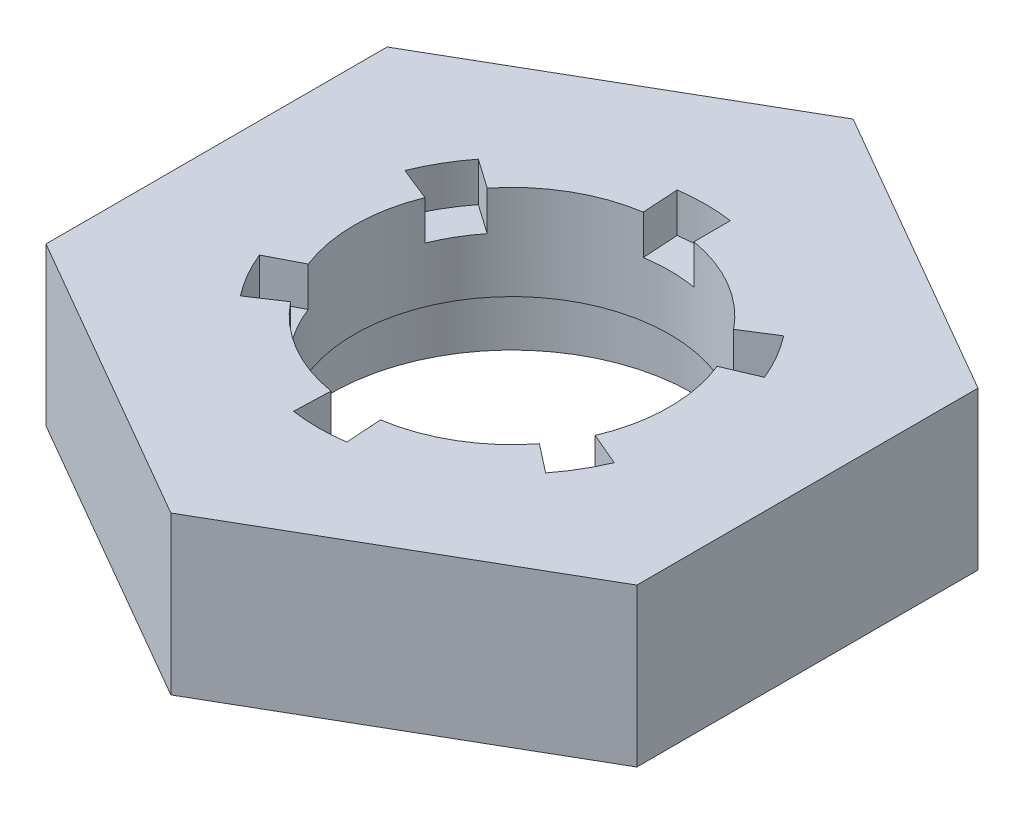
ISO-10303-21;
HEADER;
FILE_DESCRIPTION(('STEP AP214'),'2;1');
FILE_NAME('part.step','',(''),(''),'','','');
FILE_SCHEMA(('AUTOMOTIVE_DESIGN { 1 0 10303 214 1 1 1 1 }'));
ENDSEC;
DATA;
#1=APPLICATION_CONTEXT('core data for automotive mechanical design processes');
#2=APPLICATION_PROTOCOL_DEFINITION('international standard','automotive_design',2000,#1);
#3=PRODUCT_CONTEXT('',#1,'mechanical');
#4=PRODUCT('Part','Part','',(#3));
#5=PRODUCT_RELATED_PRODUCT_CATEGORY('part','',(#4));
#6=PRODUCT_DEFINITION_FORMATION('','',#4);
#7=PRODUCT_DEFINITION_CONTEXT('part definition',#1,'design');
#8=PRODUCT_DEFINITION('design','',#6,#7);
#9=PRODUCT_DEFINITION_SHAPE('','',#8);
#10=(LENGTH_UNIT() NAMED_UNIT(*) SI_UNIT(.MILLI.,.METRE.));
#11=(NAMED_UNIT(*) PLANE_ANGLE_UNIT() SI_UNIT($,.RADIAN.));
#12=(NAMED_UNIT(*) SI_UNIT($,.STERADIAN.) SOLID_ANGLE_UNIT());
#13=UNCERTAINTY_MEASURE_WITH_UNIT(LENGTH_MEASURE(1.E-05),#10,'distance_accuracy_value','');
#14=(GEOMETRIC_REPRESENTATION_CONTEXT(3) GLOBAL_UNCERTAINTY_ASSIGNED_CONTEXT((#13)) GLOBAL_UNIT_ASSIGNED_CONTEXT((#10,
#11,#12)) REPRESENTATION_CONTEXT('',''));
#15=CARTESIAN_POINT('',(0.,0.,0.));
#16=DIRECTION('',(0.,0.,1.));
#17=DIRECTION('',(1.,0.,0.));
#18=AXIS2_PLACEMENT_3D('',#15,#16,#17);
#19=CARTESIAN_POINT('',(37.4999999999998,10.,-64.95));
#20=DIRECTION('',(0.,-1.,0.));
#21=DIRECTION('',(0.,0.,-1.));
#22=AXIS2_PLACEMENT_3D('',#19,#20,#21);
#23=CYLINDRICAL_SURFACE('',#22,9.99999999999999);
#24=CARTESIAN_POINT('',(37.4999999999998,4.,-64.95));
#25=DIRECTION('',(0.,-1.,0.));
#26=DIRECTION('',(0.,0.,-1.));
#27=AXIS2_PLACEMENT_3D('',#24,#25,#26);
#28=CIRCLE('',#27,9.99999999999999);
#29=CARTESIAN_POINT('',(37.4999999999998,4.,-74.95));
#30=VERTEX_POINT('',#29);
#31=EDGE_CURVE('E38',#30,#30,#28,.T.);
#32=ORIENTED_EDGE('',*,*,#31,.T.);
#33=EDGE_LOOP('',(#32));
#34=FACE_BOUND('',#33,.T.);
#35=CARTESIAN_POINT('',(37.4999999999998,10.,-64.95));
#36=DIRECTION('',(0.,1.,0.));
#37=DIRECTION('',(0.,0.,1.));
#38=AXIS2_PLACEMENT_3D('',#35,#36,#37);
#39=CIRCLE('',#38,9.99999999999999);
#40=CARTESIAN_POINT('',(28.228574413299,10.,-68.6970878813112));
#41=VERTEX_POINT('',#40);
#42=CARTESIAN_POINT('',(28.1740695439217,10.,-61.3407035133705));
#43=VERTEX_POINT('',#42);
#44=EDGE_CURVE('E447',#41,#43,#39,.T.);
#45=ORIENTED_EDGE('',*,*,#44,.T.);
#46=DIRECTION('',(0.,1.,0.));
#47=VECTOR('',#46,1.);
#48=CARTESIAN_POINT('',(28.1740695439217,7.5,-61.3407035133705));
#49=LINE('',#48,#47);
#50=CARTESIAN_POINT('',(28.1740695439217,7.5,-61.3407035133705));
#51=VERTEX_POINT('',#50);
#52=EDGE_CURVE('E284',#51,#43,#49,.T.);
#53=ORIENTED_EDGE('',*,*,#52,.F.);
#54=CARTESIAN_POINT('',(37.4999999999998,7.5,-64.95));
#55=DIRECTION('',(0.,1.,0.));
#56=DIRECTION('',(0.,0.,1.));
#57=AXIS2_PLACEMENT_3D('',#54,#55,#56);
#58=CIRCLE('',#57,9.99999999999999);
#59=CARTESIAN_POINT('',(29.6867733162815,7.5,-58.7087269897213));
#60=VERTEX_POINT('',#59);
#61=EDGE_CURVE('E260',#60,#51,#58,.F.);
#62=ORIENTED_EDGE('',*,*,#61,.F.);
#63=DIRECTION('',(0.,1.,0.));
#64=VECTOR('',#63,1.);
#65=CARTESIAN_POINT('',(29.6867733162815,7.5,-58.7087269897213));
#66=LINE('',#65,#64);
#67=CARTESIAN_POINT('',(29.6867733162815,10.,-58.7087269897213));
#68=VERTEX_POINT('',#67);
#69=EDGE_CURVE('E250',#60,#68,#66,.T.);
#70=ORIENTED_EDGE('',*,*,#69,.T.);
#71=CARTESIAN_POINT('',(35.8820439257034,10.,-55.0817570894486));
#72=VERTEX_POINT('',#71);
#73=EDGE_CURVE('E451',#68,#72,#39,.T.);
#74=ORIENTED_EDGE('',*,*,#73,.T.);
#75=DIRECTION('',(0.,1.,0.));
#76=VECTOR('',#75,1.);
#77=CARTESIAN_POINT('',(35.8820439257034,7.5,-55.0817570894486));
#78=LINE('',#77,#76);
#79=CARTESIAN_POINT('',(35.8820439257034,7.5,-55.0817570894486));
#80=VERTEX_POINT('',#79);
#81=EDGE_CURVE('E308',#80,#72,#78,.T.);
#82=ORIENTED_EDGE('',*,*,#81,.F.);
#83=CARTESIAN_POINT('',(37.4999999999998,7.5,-64.95));
#84=DIRECTION('',(0.,1.,0.));
#85=DIRECTION('',(0.,0.,1.));
#86=AXIS2_PLACEMENT_3D('',#83,#84,#85);
#87=CIRCLE('',#86,9.99999999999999);
#88=CARTESIAN_POINT('',(39.032834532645,7.5,-55.0681773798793));
#89=VERTEX_POINT('',#88);
#90=EDGE_CURVE('E294',#89,#80,#87,.F.);
#91=ORIENTED_EDGE('',*,*,#90,.F.);
#92=DIRECTION('',(0.,1.,0.));
#93=VECTOR('',#92,1.);
#94=CARTESIAN_POINT('',(39.032834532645,7.5,-55.0681773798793));
#95=LINE('',#94,#93);
#96=CARTESIAN_POINT('',(39.032834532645,10.,-55.0681773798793));
#97=VERTEX_POINT('',#96);
#98=EDGE_CURVE('E311',#89,#97,#95,.T.);
#99=ORIENTED_EDGE('',*,*,#98,.T.);
#100=CARTESIAN_POINT('',(45.3856283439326,10.,-58.8004580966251));
#101=VERTEX_POINT('',#100);
#102=EDGE_CURVE('E555',#97,#101,#39,.T.);
#103=ORIENTED_EDGE('',*,*,#102,.T.);
#104=DIRECTION('',(0.,1.,0.));
#105=VECTOR('',#104,1.);
#106=CARTESIAN_POINT('',(45.3856283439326,7.5,-58.8004580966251));
#107=LINE('',#106,#105);
#108=CARTESIAN_POINT('',(45.3856283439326,7.5,-58.8004580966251));
#109=VERTEX_POINT('',#108);
#110=EDGE_CURVE('E334',#109,#101,#107,.T.);
#111=ORIENTED_EDGE('',*,*,#110,.F.);
#112=CARTESIAN_POINT('',(37.4999999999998,7.5,-64.95));
#113=DIRECTION('',(0.,1.,0.));
#114=DIRECTION('',(0.,0.,1.));
#115=AXIS2_PLACEMENT_3D('',#112,#113,#114);
#116=CIRCLE('',#115,9.99999999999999);
#117=CARTESIAN_POINT('',(46.6993393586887,7.5,-61.0292659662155));
#118=VERTEX_POINT('',#117);
#119=EDGE_CURVE('E324',#118,#109,#116,.F.);
#120=ORIENTED_EDGE('',*,*,#119,.F.);
#121=DIRECTION('',(0.,1.,0.));
#122=VECTOR('',#121,1.);
#123=CARTESIAN_POINT('',(46.6993393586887,7.5,-61.0292659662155));
#124=LINE('',#123,#122);
#125=CARTESIAN_POINT('',(46.6993393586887,10.,-61.0292659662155));
#126=VERTEX_POINT('',#125);
#127=EDGE_CURVE('E338',#118,#126,#124,.T.);
#128=ORIENTED_EDGE('',*,*,#127,.T.);
#129=CARTESIAN_POINT('',(46.7714255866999,10.,-68.6970878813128));
#130=VERTEX_POINT('',#129);
#131=EDGE_CURVE('E556',#126,#130,#39,.T.);
#132=ORIENTED_EDGE('',*,*,#131,.T.);
#133=DIRECTION('',(0.,1.,0.));
#134=VECTOR('',#133,1.);
#135=CARTESIAN_POINT('',(46.7714255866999,7.5,-68.6970878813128));
#136=LINE('',#135,#134);
#137=CARTESIAN_POINT('',(46.7714255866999,7.5,-68.6970878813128));
#138=VERTEX_POINT('',#137);
#139=EDGE_CURVE('E364',#138,#130,#136,.T.);
#140=ORIENTED_EDGE('',*,*,#139,.F.);
#141=CARTESIAN_POINT('',(37.4999999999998,7.5,-64.95));
#142=DIRECTION('',(0.,1.,0.));
#143=DIRECTION('',(0.,0.,1.));
#144=AXIS2_PLACEMENT_3D('',#141,#142,#143);
#145=CIRCLE('',#144,9.99999999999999);
#146=CARTESIAN_POINT('',(45.2645379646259,7.5,-71.2517418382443));
#147=VERTEX_POINT('',#146);
#148=EDGE_CURVE('E354',#147,#138,#145,.F.);
#149=ORIENTED_EDGE('',*,*,#148,.F.);
#150=DIRECTION('',(0.,1.,0.));
#151=VECTOR('',#150,1.);
#152=CARTESIAN_POINT('',(45.2645379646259,7.5,-71.2517418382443));
#153=LINE('',#152,#151);
#154=CARTESIAN_POINT('',(45.2645379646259,10.,-71.2517418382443));
#155=VERTEX_POINT('',#154);
#156=EDGE_CURVE('E368',#147,#155,#153,.T.);
#157=ORIENTED_EDGE('',*,*,#156,.T.);
#158=CARTESIAN_POINT('',(39.1914551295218,10.,-74.8059108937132));
#159=VERTEX_POINT('',#158);
#160=EDGE_CURVE('E559',#155,#159,#39,.T.);
#161=ORIENTED_EDGE('',*,*,#160,.T.);
#162=DIRECTION('',(0.,1.,0.));
#163=VECTOR('',#162,1.);
#164=CARTESIAN_POINT('',(39.1914551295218,7.5,-74.8059108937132));
#165=LINE('',#164,#163);
#166=CARTESIAN_POINT('',(39.1914551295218,7.5,-74.8059108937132));
#167=VERTEX_POINT('',#166);
#168=EDGE_CURVE('E394',#167,#159,#165,.T.);
#169=ORIENTED_EDGE('',*,*,#168,.F.);
#170=CARTESIAN_POINT('',(37.4999999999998,7.5,-64.95));
#171=DIRECTION('',(0.,1.,0.));
#172=DIRECTION('',(0.,0.,1.));
#173=AXIS2_PLACEMENT_3D('',#170,#171,#172);
#174=CIRCLE('',#173,9.99999999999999);
#175=CARTESIAN_POINT('',(35.9507430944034,7.5,-74.8292612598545));
#176=VERTEX_POINT('',#175);
#177=EDGE_CURVE('E384',#176,#167,#174,.F.);
#178=ORIENTED_EDGE('',*,*,#177,.F.);
#179=DIRECTION('',(0.,1.,0.));
#180=VECTOR('',#179,1.);
#181=CARTESIAN_POINT('',(35.9507430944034,7.5,-74.8292612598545));
#182=LINE('',#181,#180);
#183=CARTESIAN_POINT('',(35.9507430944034,10.,-74.8292612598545));
#184=VERTEX_POINT('',#183);
#185=EDGE_CURVE('E398',#176,#184,#182,.T.);
#186=ORIENTED_EDGE('',*,*,#185,.T.);
#187=CARTESIAN_POINT('',(29.6867733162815,10.,-71.1912730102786));
#188=VERTEX_POINT('',#187);
#189=EDGE_CURVE('E452',#184,#188,#39,.T.);
#190=ORIENTED_EDGE('',*,*,#189,.T.);
#191=DIRECTION('',(0.,1.,0.));
#192=VECTOR('',#191,1.);
#193=CARTESIAN_POINT('',(29.6867733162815,7.5,-71.1912730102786));
#194=LINE('',#193,#192);
#195=CARTESIAN_POINT('',(29.6867733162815,7.5,-71.1912730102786));
#196=VERTEX_POINT('',#195);
#197=EDGE_CURVE('E434',#196,#188,#194,.T.);
#198=ORIENTED_EDGE('',*,*,#197,.F.);
#199=CARTESIAN_POINT('',(37.4999999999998,7.5,-64.95));
#200=DIRECTION('',(0.,1.,0.));
#201=DIRECTION('',(0.,0.,1.));
#202=AXIS2_PLACEMENT_3D('',#199,#200,#201);
#203=CIRCLE('',#202,9.99999999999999);
#204=CARTESIAN_POINT('',(28.228574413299,7.5,-68.6970878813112));
#205=VERTEX_POINT('',#204);
#206=EDGE_CURVE('E412',#205,#196,#203,.F.);
#207=ORIENTED_EDGE('',*,*,#206,.F.);
#208=DIRECTION('',(0.,1.,0.));
#209=VECTOR('',#208,1.);
#210=CARTESIAN_POINT('',(28.228574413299,7.5,-68.6970878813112));
#211=LINE('',#210,#209);
#212=EDGE_CURVE('E437',#205,#41,#211,.T.);
#213=ORIENTED_EDGE('',*,*,#212,.T.);
#214=EDGE_LOOP('',(#45,#53,#62,#70,#74,#82,#91,#99,#103,#111,#120,#128,#132,#140,#149,#157,#161,
#169,#178,#186,#190,#198,#207,#213));
#215=FACE_BOUND('',#214,.T.);
#216=ADVANCED_FACE('F35',(#34,#215),#23,.F.);
#217=CARTESIAN_POINT('',(-39.812134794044,10.,-64.95));
#218=DIRECTION('',(0.,1.,0.));
#219=DIRECTION('',(0.,0.,1.));
#220=AXIS2_PLACEMENT_3D('',#217,#218,#219);
#221=PLANE('',#220);
#222=DIRECTION('',(-0.866025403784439,0.,-0.5));
#223=VECTOR('',#222,1.);
#224=CARTESIAN_POINT('',(-11.1091010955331,10.,-114.665112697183));
#225=LINE('',#224,#223);
#226=CARTESIAN_POINT('',(56.2499999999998,10.,-75.7753175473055));
#227=VERTEX_POINT('',#226);
#228=CARTESIAN_POINT('',(37.4999999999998,10.,-86.600635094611));
#229=VERTEX_POINT('',#228);
#230=EDGE_CURVE('E450',#227,#229,#225,.T.);
#231=ORIENTED_EDGE('',*,*,#230,.T.);
#232=DIRECTION('',(-0.866025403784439,0.,0.499999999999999));
#233=VECTOR('',#232,1.);
#234=CARTESIAN_POINT('',(-29.8591010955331,10.,-47.7108399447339));
#235=LINE('',#234,#233);
#236=CARTESIAN_POINT('',(18.7499999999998,10.,-75.7753175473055));
#237=VERTEX_POINT('',#236);
#238=EDGE_CURVE('E455',#229,#237,#235,.T.);
#239=ORIENTED_EDGE('',*,*,#238,.T.);
#240=DIRECTION('',(0.,0.,-1.));
#241=VECTOR('',#240,1.);
#242=CARTESIAN_POINT('',(18.7499999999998,10.,-64.95));
#243=LINE('',#242,#241);
#244=CARTESIAN_POINT('',(18.7499999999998,10.,-54.1246824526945));
#245=VERTEX_POINT('',#244);
#246=EDGE_CURVE('E457',#245,#237,#243,.T.);
#247=ORIENTED_EDGE('',*,*,#246,.F.);
#248=DIRECTION('',(0.866025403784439,0.,0.5));
#249=VECTOR('',#248,1.);
#250=CARTESIAN_POINT('',(-29.8591010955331,10.,-82.1891600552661));
#251=LINE('',#250,#249);
#252=CARTESIAN_POINT('',(37.4999999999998,10.,-43.299364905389));
#253=VERTEX_POINT('',#252);
#254=EDGE_CURVE('E460',#245,#253,#251,.T.);
#255=ORIENTED_EDGE('',*,*,#254,.T.);
#256=DIRECTION('',(0.866025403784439,0.,-0.5));
#257=VECTOR('',#256,1.);
#258=CARTESIAN_POINT('',(-11.1091010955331,10.,-15.2348873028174));
#259=LINE('',#258,#257);
#260=CARTESIAN_POINT('',(56.2499999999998,10.,-54.1246824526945));
#261=VERTEX_POINT('',#260);
#262=EDGE_CURVE('E462',#253,#261,#259,.T.);
#263=ORIENTED_EDGE('',*,*,#262,.T.);
#264=DIRECTION('',(0.,0.,-1.));
#265=VECTOR('',#264,1.);
#266=CARTESIAN_POINT('',(56.2499999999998,10.,-64.95));
#267=LINE('',#266,#265);
#268=EDGE_CURVE('E464',#261,#227,#267,.T.);
#269=ORIENTED_EDGE('',*,*,#268,.T.);
#270=EDGE_LOOP('',(#231,#239,#247,#255,#263,#269));
#271=FACE_BOUND('',#270,.T.);
#272=CARTESIAN_POINT('',(37.4999999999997,10.,-64.949999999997));
#273=DIRECTION('',(0.,1.,0.));
#274=DIRECTION('',(0.,0.,1.));
#275=AXIS2_PLACEMENT_3D('',#272,#273,#274);
#276=CIRCLE('',#275,12.2890875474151);
#277=CARTESIAN_POINT('',(26.1297216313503,10.,-60.2875497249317));
#278=VERTEX_POINT('',#277);
#279=CARTESIAN_POINT('',(27.7759626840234,10.,-57.4356955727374));
#280=VERTEX_POINT('',#279);
#281=EDGE_CURVE('E265',#278,#280,#276,.T.);
#282=ORIENTED_EDGE('',*,*,#281,.F.);
#283=DIRECTION('',(0.888973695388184,0.,-0.45795826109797));
#284=VECTOR('',#283,1.);
#285=CARTESIAN_POINT('',(-134.460448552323,10.,22.4411018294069));
#286=LINE('',#285,#284);
#287=EDGE_CURVE('E268',#278,#43,#286,.T.);
#288=ORIENTED_EDGE('',*,*,#287,.T.);
#289=ORIENTED_EDGE('',*,*,#44,.F.);
#290=DIRECTION('',(0.928058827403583,0.,0.372433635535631));
#291=VECTOR('',#290,1.);
#292=CARTESIAN_POINT('',(-99.9016395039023,10.,-120.116243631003));
#293=LINE('',#292,#291);
#294=CARTESIAN_POINT('',(26.1403306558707,10.,-69.5351082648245));
#295=VERTEX_POINT('',#294);
#296=EDGE_CURVE('E422',#295,#41,#293,.T.);
#297=ORIENTED_EDGE('',*,*,#296,.F.);
#298=CARTESIAN_POINT('',(26.8531989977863,10.,-71.0873692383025));
#299=DIRECTION('',(0.,1.,0.));
#300=DIRECTION('',(0.,0.,1.));
#301=AXIS2_PLACEMENT_3D('',#298,#299,#300);
#302=CIRCLE('',#301,1.70812628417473);
#303=CARTESIAN_POINT('',(26.1050422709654,10.,-69.5518052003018));
#304=VERTEX_POINT('',#303);
#305=EDGE_CURVE('E397',#304,#295,#302,.T.);
#306=ORIENTED_EDGE('',*,*,#305,.F.);
#307=CARTESIAN_POINT('',(37.4999999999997,10.,-64.949999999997));
#308=DIRECTION('',(0.,1.,0.));
#309=DIRECTION('',(0.,0.,1.));
#310=AXIS2_PLACEMENT_3D('',#307,#308,#309);
#311=CIRCLE('',#310,12.2890875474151);
#312=CARTESIAN_POINT('',(27.8070488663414,10.,-72.5043610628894));
#313=VERTEX_POINT('',#312);
#314=EDGE_CURVE('E409',#313,#304,#311,.T.);
#315=ORIENTED_EDGE('',*,*,#314,.F.);
#316=DIRECTION('',(0.819788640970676,0.,0.572666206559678));
#317=VECTOR('',#316,1.);
#318=CARTESIAN_POINT('',(-56.8310015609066,10.,-131.628565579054));
#319=LINE('',#318,#317);
#320=EDGE_CURVE('E424',#313,#188,#319,.T.);
#321=ORIENTED_EDGE('',*,*,#320,.T.);
#322=ORIENTED_EDGE('',*,*,#189,.F.);
#323=DIRECTION('',(-0.0601450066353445,0.,-0.99818965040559));
#324=VECTOR('',#323,1.);
#325=CARTESIAN_POINT('',(39.6441959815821,10.,-13.5312973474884));
#326=LINE('',#325,#324);
#327=CARTESIAN_POINT('',(35.8125550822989,10.,-77.1226826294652));
#328=VERTEX_POINT('',#327);
#329=EDGE_CURVE('E379',#184,#328,#326,.T.);
#330=ORIENTED_EDGE('',*,*,#329,.T.);
#331=CARTESIAN_POINT('',(37.4999999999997,10.,-64.949999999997));
#332=DIRECTION('',(0.,1.,0.));
#333=DIRECTION('',(0.,0.,1.));
#334=AXIS2_PLACEMENT_3D('',#331,#332,#333);
#335=CIRCLE('',#334,12.2890875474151);
#336=CARTESIAN_POINT('',(39.1885182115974,10.,-77.122533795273));
#337=VERTEX_POINT('',#336);
#338=EDGE_CURVE('E389',#337,#328,#335,.T.);
#339=ORIENTED_EDGE('',*,*,#338,.F.);
#340=DIRECTION('',(-0.00126775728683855,0.,-0.999999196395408));
#341=VECTOR('',#340,1.);
#342=CARTESIAN_POINT('',(39.2831088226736,10.,-2.51003813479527));
#343=LINE('',#342,#341);
#344=EDGE_CURVE('E367',#159,#337,#343,.T.);
#345=ORIENTED_EDGE('',*,*,#344,.F.);
#346=ORIENTED_EDGE('',*,*,#160,.F.);
#347=DIRECTION('',(-0.845089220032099,0.,0.534625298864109));
#348=VECTOR('',#347,1.);
#349=CARTESIAN_POINT('',(-123.348233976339,10.,35.417058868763));
#350=LINE('',#349,#348);
#351=CARTESIAN_POINT('',(47.2099704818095,10.,-72.4824727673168));
#352=VERTEX_POINT('',#351);
#353=EDGE_CURVE('E348',#352,#155,#350,.T.);
#354=ORIENTED_EDGE('',*,*,#353,.F.);
#355=CARTESIAN_POINT('',(37.4999999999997,10.,-64.949999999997));
#356=DIRECTION('',(0.,1.,0.));
#357=DIRECTION('',(0.,0.,1.));
#358=AXIS2_PLACEMENT_3D('',#355,#356,#357);
#359=CIRCLE('',#358,12.2890875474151);
#360=CARTESIAN_POINT('',(48.8782980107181,10.,-69.5928447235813));
#361=VERTEX_POINT('',#360);
#362=EDGE_CURVE('E360',#361,#352,#359,.T.);
#363=ORIENTED_EDGE('',*,*,#362,.F.);
#364=DIRECTION('',(-0.920278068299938,0.,0.391264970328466));
#365=VECTOR('',#364,1.);
#366=CARTESIAN_POINT('',(-141.416025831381,10.,11.3125962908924));
#367=LINE('',#366,#365);
#368=EDGE_CURVE('E337',#361,#130,#367,.T.);
#369=ORIENTED_EDGE('',*,*,#368,.T.);
#370=ORIENTED_EDGE('',*,*,#131,.F.);
#371=DIRECTION('',(-0.919933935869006,0.,-0.392073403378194));
#372=VECTOR('',#371,1.);
#373=CARTESIAN_POINT('',(-96.1949322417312,10.,-121.930425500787));
#374=LINE('',#373,#372);
#375=CARTESIAN_POINT('',(48.8051486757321,10.,-60.1317756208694));
#376=VERTEX_POINT('',#375);
#377=EDGE_CURVE('E318',#376,#126,#374,.T.);
#378=ORIENTED_EDGE('',*,*,#377,.F.);
#379=CARTESIAN_POINT('',(37.4999999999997,10.,-64.949999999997));
#380=DIRECTION('',(0.,1.,0.));
#381=DIRECTION('',(0.,0.,1.));
#382=AXIS2_PLACEMENT_3D('',#379,#380,#381);
#383=CIRCLE('',#382,12.2890875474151);
#384=CARTESIAN_POINT('',(47.1907177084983,10.,-57.3927741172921));
#385=VERTEX_POINT('',#384);
#386=EDGE_CURVE('E330',#385,#376,#383,.T.);
#387=ORIENTED_EDGE('',*,*,#386,.F.);
#388=DIRECTION('',(-0.788562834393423,0.,-0.614954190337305));
#389=VECTOR('',#388,1.);
#390=CARTESIAN_POINT('',(-46.9538338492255,10.,-130.810622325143));
#391=LINE('',#390,#389);
#392=EDGE_CURVE('E307',#385,#101,#391,.T.);
#393=ORIENTED_EDGE('',*,*,#392,.T.);
#394=ORIENTED_EDGE('',*,*,#102,.F.);
#395=DIRECTION('',(-0.0674178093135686,0.,-0.997724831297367));
#396=VECTOR('',#395,1.);
#397=CARTESIAN_POINT('',(41.7376057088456,10.,-15.0399208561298));
#398=LINE('',#397,#396);
#399=CARTESIAN_POINT('',(39.1876297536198,10.,-52.7773429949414));
#400=VERTEX_POINT('',#399);
#401=EDGE_CURVE('E301',#400,#97,#398,.T.);
#402=ORIENTED_EDGE('',*,*,#401,.F.);
#403=CARTESIAN_POINT('',(37.4999999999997,10.,-64.949999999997));
#404=DIRECTION('',(0.,1.,0.));
#405=DIRECTION('',(0.,0.,1.));
#406=AXIS2_PLACEMENT_3D('',#403,#404,#405);
#407=CIRCLE('',#406,12.2890875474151);
#408=CARTESIAN_POINT('',(35.8053224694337,10.,-52.7783221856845));
#409=VERTEX_POINT('',#408);
#410=EDGE_CURVE('E58',#409,#400,#407,.T.);
#411=ORIENTED_EDGE('',*,*,#410,.F.);
#412=DIRECTION('',(0.0332889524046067,0.,-0.999445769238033));
#413=VECTOR('',#412,1.);
#414=CARTESIAN_POINT('',(33.9222163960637,10.,3.75882488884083));
#415=LINE('',#414,#413);
#416=EDGE_CURVE('E291',#409,#72,#415,.T.);
#417=ORIENTED_EDGE('',*,*,#416,.T.);
#418=ORIENTED_EDGE('',*,*,#73,.F.);
#419=DIRECTION('',(0.832689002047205,0.,-0.553740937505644));
#420=VECTOR('',#419,1.);
#421=CARTESIAN_POINT('',(-118.977952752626,10.,40.1538070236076));
#422=LINE('',#421,#420);
#423=CARTESIAN_POINT('',(27.8070488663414,10.,-57.4587040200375));
#424=VERTEX_POINT('',#423);
#425=EDGE_CURVE('E276',#424,#68,#422,.T.);
#426=ORIENTED_EDGE('',*,*,#425,.F.);
#427=CARTESIAN_POINT('',(26.8074922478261,10.,-58.7766777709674));
#428=DIRECTION('',(0.,1.,0.));
#429=DIRECTION('',(0.,0.,1.));
#430=AXIS2_PLACEMENT_3D('',#427,#428,#429);
#431=CIRCLE('',#430,1.65413670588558);
#432=EDGE_CURVE('E50',#280,#424,#431,.T.);
#433=ORIENTED_EDGE('',*,*,#432,.F.);
#434=EDGE_LOOP('',(#282,#288,#289,#297,#306,#315,#321,#322,#330,#339,#345,#346,#354,#363,#369,
#370,#378,#387,#393,#394,#402,#411,#417,#418,#426,#433));
#435=FACE_BOUND('',#434,.T.);
#436=ADVANCED_FACE('F516',(#271,#435),#221,.T.);
#437=CARTESIAN_POINT('',(-11.1091010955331,10.,-114.665112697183));
#438=DIRECTION('',(-0.5,0.,0.866025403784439));
#439=DIRECTION('',(0.866025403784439,0.,0.5));
#440=AXIS2_PLACEMENT_3D('',#437,#438,#439);
#441=PLANE('',#440);
#442=DIRECTION('',(-0.866025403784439,0.,-0.5));
#443=VECTOR('',#442,1.);
#444=CARTESIAN_POINT('',(-11.1091010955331,0.,-114.665112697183));
#445=LINE('',#444,#443);
#446=CARTESIAN_POINT('',(56.2499999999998,0.,-75.7753175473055));
#447=VERTEX_POINT('',#446);
#448=CARTESIAN_POINT('',(37.4999999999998,0.,-86.600635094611));
#449=VERTEX_POINT('',#448);
#450=EDGE_CURVE('E467',#447,#449,#445,.T.);
#451=ORIENTED_EDGE('',*,*,#450,.T.);
#452=DIRECTION('',(0.,-1.,0.));
#453=VECTOR('',#452,1.);
#454=CARTESIAN_POINT('',(37.4999999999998,10.,-86.600635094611));
#455=LINE('',#454,#453);
#456=EDGE_CURVE('E11',#229,#449,#455,.T.);
#457=ORIENTED_EDGE('',*,*,#456,.F.);
#458=ORIENTED_EDGE('',*,*,#230,.F.);
#459=DIRECTION('',(0.,-1.,0.));
#460=VECTOR('',#459,1.);
#461=CARTESIAN_POINT('',(56.2499999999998,10.,-75.7753175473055));
#462=LINE('',#461,#460);
#463=EDGE_CURVE('E466',#227,#447,#462,.T.);
#464=ORIENTED_EDGE('',*,*,#463,.T.);
#465=EDGE_LOOP('',(#451,#457,#458,#464));
#466=FACE_BOUND('',#465,.T.);
#467=ADVANCED_FACE('F521',(#466),#441,.F.);
#468=CARTESIAN_POINT('',(-29.8591010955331,10.,-47.7108399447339));
#469=DIRECTION('',(0.499999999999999,0.,0.866025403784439));
#470=DIRECTION('',(0.866025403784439,0.,-0.499999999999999));
#471=AXIS2_PLACEMENT_3D('',#468,#469,#470);
#472=PLANE('',#471);
#473=DIRECTION('',(-0.866025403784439,0.,0.499999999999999));
#474=VECTOR('',#473,1.);
#475=CARTESIAN_POINT('',(-29.8591010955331,0.,-47.7108399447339));
#476=LINE('',#475,#474);
#477=CARTESIAN_POINT('',(18.7499999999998,0.,-75.7753175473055));
#478=VERTEX_POINT('',#477);
#479=EDGE_CURVE('E470',#449,#478,#476,.T.);
#480=ORIENTED_EDGE('',*,*,#479,.T.);
#481=DIRECTION('',(0.,-1.,0.));
#482=VECTOR('',#481,1.);
#483=CARTESIAN_POINT('',(18.7499999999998,10.,-75.7753175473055));
#484=LINE('',#483,#482);
#485=EDGE_CURVE('E43',#237,#478,#484,.T.);
#486=ORIENTED_EDGE('',*,*,#485,.F.);
#487=ORIENTED_EDGE('',*,*,#238,.F.);
#488=ORIENTED_EDGE('',*,*,#456,.T.);
#489=EDGE_LOOP('',(#480,#486,#487,#488));
#490=FACE_BOUND('',#489,.T.);
#491=ADVANCED_FACE('F498',(#490),#472,.F.);
#492=CARTESIAN_POINT('',(18.7499999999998,10.,-64.95));
#493=DIRECTION('',(-1.,0.,0.));
#494=DIRECTION('',(0.,0.,1.));
#495=AXIS2_PLACEMENT_3D('',#492,#493,#494);
#496=PLANE('',#495);
#497=DIRECTION('',(0.,0.,-1.));
#498=VECTOR('',#497,1.);
#499=CARTESIAN_POINT('',(18.7499999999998,0.,-64.95));
#500=LINE('',#499,#498);
#501=CARTESIAN_POINT('',(18.7499999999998,0.,-54.1246824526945));
#502=VERTEX_POINT('',#501);
#503=EDGE_CURVE('E473',#502,#478,#500,.T.);
#504=ORIENTED_EDGE('',*,*,#503,.F.);
#505=DIRECTION('',(0.,-1.,0.));
#506=VECTOR('',#505,1.);
#507=CARTESIAN_POINT('',(18.7499999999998,10.,-54.1246824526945));
#508=LINE('',#507,#506);
#509=EDGE_CURVE('E490',#245,#502,#508,.T.);
#510=ORIENTED_EDGE('',*,*,#509,.F.);
#511=ORIENTED_EDGE('',*,*,#246,.T.);
#512=ORIENTED_EDGE('',*,*,#485,.T.);
#513=EDGE_LOOP('',(#504,#510,#511,#512));
#514=FACE_BOUND('',#513,.T.);
#515=ADVANCED_FACE('F495',(#514),#496,.T.);
#516=CARTESIAN_POINT('',(-29.8591010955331,10.,-82.1891600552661));
#517=DIRECTION('',(0.5,0.,-0.866025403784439));
#518=DIRECTION('',(-0.866025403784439,0.,-0.5));
#519=AXIS2_PLACEMENT_3D('',#516,#517,#518);
#520=PLANE('',#519);
#521=DIRECTION('',(0.866025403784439,0.,0.5));
#522=VECTOR('',#521,1.);
#523=CARTESIAN_POINT('',(-29.8591010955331,0.,-82.1891600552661));
#524=LINE('',#523,#522);
#525=CARTESIAN_POINT('',(37.4999999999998,0.,-43.299364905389));
#526=VERTEX_POINT('',#525);
#527=EDGE_CURVE('E476',#502,#526,#524,.T.);
#528=ORIENTED_EDGE('',*,*,#527,.T.);
#529=DIRECTION('',(0.,-1.,0.));
#530=VECTOR('',#529,1.);
#531=CARTESIAN_POINT('',(37.4999999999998,10.,-43.299364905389));
#532=LINE('',#531,#530);
#533=EDGE_CURVE('E487',#253,#526,#532,.T.);
#534=ORIENTED_EDGE('',*,*,#533,.F.);
#535=ORIENTED_EDGE('',*,*,#254,.F.);
#536=ORIENTED_EDGE('',*,*,#509,.T.);
#537=EDGE_LOOP('',(#528,#534,#535,#536));
#538=FACE_BOUND('',#537,.T.);
#539=ADVANCED_FACE('F508',(#538),#520,.F.);
#540=CARTESIAN_POINT('',(-11.1091010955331,10.,-15.2348873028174));
#541=DIRECTION('',(-0.5,0.,-0.866025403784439));
#542=DIRECTION('',(-0.866025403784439,0.,0.5));
#543=AXIS2_PLACEMENT_3D('',#540,#541,#542);
#544=PLANE('',#543);
#545=DIRECTION('',(0.866025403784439,0.,-0.5));
#546=VECTOR('',#545,1.);
#547=CARTESIAN_POINT('',(-11.1091010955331,0.,-15.2348873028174));
#548=LINE('',#547,#546);
#549=CARTESIAN_POINT('',(56.2499999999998,0.,-54.1246824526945));
#550=VERTEX_POINT('',#549);
#551=EDGE_CURVE('E478',#526,#550,#548,.T.);
#552=ORIENTED_EDGE('',*,*,#551,.T.);
#553=DIRECTION('',(0.,-1.,0.));
#554=VECTOR('',#553,1.);
#555=CARTESIAN_POINT('',(56.2499999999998,10.,-54.1246824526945));
#556=LINE('',#555,#554);
#557=EDGE_CURVE('E484',#261,#550,#556,.T.);
#558=ORIENTED_EDGE('',*,*,#557,.F.);
#559=ORIENTED_EDGE('',*,*,#262,.F.);
#560=ORIENTED_EDGE('',*,*,#533,.T.);
#561=EDGE_LOOP('',(#552,#558,#559,#560));
#562=FACE_BOUND('',#561,.T.);
#563=ADVANCED_FACE('F512',(#562),#544,.F.);
#564=CARTESIAN_POINT('',(56.2499999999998,10.,-64.95));
#565=DIRECTION('',(-1.,0.,0.));
#566=DIRECTION('',(0.,0.,1.));
#567=AXIS2_PLACEMENT_3D('',#564,#565,#566);
#568=PLANE('',#567);
#569=DIRECTION('',(0.,0.,-1.));
#570=VECTOR('',#569,1.);
#571=CARTESIAN_POINT('',(56.2499999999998,0.,-64.95));
#572=LINE('',#571,#570);
#573=EDGE_CURVE('E480',#550,#447,#572,.T.);
#574=ORIENTED_EDGE('',*,*,#573,.T.);
#575=ORIENTED_EDGE('',*,*,#463,.F.);
#576=ORIENTED_EDGE('',*,*,#268,.F.);
#577=ORIENTED_EDGE('',*,*,#557,.T.);
#578=EDGE_LOOP('',(#574,#575,#576,#577));
#579=FACE_BOUND('',#578,.T.);
#580=ADVANCED_FACE('F523',(#579),#568,.F.);
#581=CARTESIAN_POINT('',(-39.812134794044,0.,-64.95));
#582=DIRECTION('',(0.,1.,0.));
#583=DIRECTION('',(0.,0.,1.));
#584=AXIS2_PLACEMENT_3D('',#581,#582,#583);
#585=PLANE('',#584);
#586=CARTESIAN_POINT('',(37.4999999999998,0.,-64.95));
#587=DIRECTION('',(0.,-1.,0.));
#588=DIRECTION('',(0.,0.,-1.));
#589=AXIS2_PLACEMENT_3D('',#586,#587,#588);
#590=CIRCLE('',#589,11.5);
#591=CARTESIAN_POINT('',(37.4999999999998,0.,-76.45));
#592=VERTEX_POINT('',#591);
#593=EDGE_CURVE('E431',#592,#592,#590,.T.);
#594=ORIENTED_EDGE('',*,*,#593,.F.);
#595=EDGE_LOOP('',(#594));
#596=FACE_BOUND('',#595,.T.);
#597=ORIENTED_EDGE('',*,*,#450,.F.);
#598=ORIENTED_EDGE('',*,*,#573,.F.);
#599=ORIENTED_EDGE('',*,*,#551,.F.);
#600=ORIENTED_EDGE('',*,*,#527,.F.);
#601=ORIENTED_EDGE('',*,*,#503,.T.);
#602=ORIENTED_EDGE('',*,*,#479,.F.);
#603=EDGE_LOOP('',(#597,#598,#599,#600,#601,#602));
#604=FACE_BOUND('',#603,.T.);
#605=ADVANCED_FACE('F503',(#596,#604),#585,.F.);
#606=CARTESIAN_POINT('',(37.4999999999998,4.,-64.95));
#607=DIRECTION('',(0.,-1.,0.));
#608=DIRECTION('',(0.,0.,-1.));
#609=AXIS2_PLACEMENT_3D('',#606,#607,#608);
#610=CYLINDRICAL_SURFACE('',#609,11.5);
#611=CARTESIAN_POINT('',(37.4999999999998,4.,-64.95));
#612=DIRECTION('',(0.,-1.,0.));
#613=DIRECTION('',(0.,0.,-1.));
#614=AXIS2_PLACEMENT_3D('',#611,#612,#613);
#615=CIRCLE('',#614,11.5);
#616=CARTESIAN_POINT('',(37.4999999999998,4.,-76.45));
#617=VERTEX_POINT('',#616);
#618=EDGE_CURVE('E442',#617,#617,#615,.T.);
#619=ORIENTED_EDGE('',*,*,#618,.F.);
#620=EDGE_LOOP('',(#619));
#621=FACE_BOUND('',#620,.T.);
#622=ORIENTED_EDGE('',*,*,#593,.T.);
#623=EDGE_LOOP('',(#622));
#624=FACE_BOUND('',#623,.T.);
#625=ADVANCED_FACE('F530',(#621,#624),#610,.F.);
#626=CARTESIAN_POINT('',(37.4999999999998,4.,-64.95));
#627=DIRECTION('',(0.,-1.,0.));
#628=DIRECTION('',(0.,0.,-1.));
#629=AXIS2_PLACEMENT_3D('',#626,#627,#628);
#630=PLANE('',#629);
#631=ORIENTED_EDGE('',*,*,#31,.F.);
#632=EDGE_LOOP('',(#631));
#633=FACE_BOUND('',#632,.T.);
#634=ORIENTED_EDGE('',*,*,#618,.T.);
#635=EDGE_LOOP('',(#634));
#636=FACE_BOUND('',#635,.T.);
#637=ADVANCED_FACE('F584',(#633,#636),#630,.T.);
#638=CARTESIAN_POINT('',(26.8531989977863,7.5,-71.0873692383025));
#639=DIRECTION('',(0.,1.,0.));
#640=DIRECTION('',(0.,0.,1.));
#641=AXIS2_PLACEMENT_3D('',#638,#639,#640);
#642=CYLINDRICAL_SURFACE('',#641,1.70812628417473);
#643=ORIENTED_EDGE('',*,*,#305,.T.);
#644=DIRECTION('',(0.,1.,0.));
#645=VECTOR('',#644,1.);
#646=CARTESIAN_POINT('',(26.1403306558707,7.5,-69.5351082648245));
#647=LINE('',#646,#645);
#648=CARTESIAN_POINT('',(26.1403306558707,7.5,-69.5351082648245));
#649=VERTEX_POINT('',#648);
#650=EDGE_CURVE('E420',#649,#295,#647,.T.);
#651=ORIENTED_EDGE('',*,*,#650,.F.);
#652=CARTESIAN_POINT('',(26.8531989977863,7.5,-71.0873692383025));
#653=DIRECTION('',(0.,1.,0.));
#654=DIRECTION('',(0.,0.,1.));
#655=AXIS2_PLACEMENT_3D('',#652,#653,#654);
#656=CIRCLE('',#655,1.70812628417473);
#657=CARTESIAN_POINT('',(26.1050422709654,7.5,-69.5518052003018));
#658=VERTEX_POINT('',#657);
#659=EDGE_CURVE('E405',#658,#649,#656,.T.);
#660=ORIENTED_EDGE('',*,*,#659,.F.);
#661=DIRECTION('',(0.,1.,0.));
#662=VECTOR('',#661,1.);
#663=CARTESIAN_POINT('',(26.1050422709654,7.5,-69.5518052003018));
#664=LINE('',#663,#662);
#665=EDGE_CURVE('E429',#658,#304,#664,.T.);
#666=ORIENTED_EDGE('',*,*,#665,.T.);
#667=EDGE_LOOP('',(#643,#651,#660,#666));
#668=FACE_BOUND('',#667,.T.);
#669=ADVANCED_FACE('F582',(#668),#642,.F.);
#670=CARTESIAN_POINT('',(37.4999999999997,7.5,-64.949999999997));
#671=DIRECTION('',(0.,1.,0.));
#672=DIRECTION('',(0.,0.,1.));
#673=AXIS2_PLACEMENT_3D('',#670,#671,#672);
#674=CYLINDRICAL_SURFACE('',#673,12.2890875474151);
#675=ORIENTED_EDGE('',*,*,#314,.T.);
#676=ORIENTED_EDGE('',*,*,#665,.F.);
#677=CARTESIAN_POINT('',(37.4999999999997,7.5,-64.949999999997));
#678=DIRECTION('',(0.,1.,0.));
#679=DIRECTION('',(0.,0.,1.));
#680=AXIS2_PLACEMENT_3D('',#677,#678,#679);
#681=CIRCLE('',#680,12.2890875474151);
#682=CARTESIAN_POINT('',(27.8070488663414,7.5,-72.5043610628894));
#683=VERTEX_POINT('',#682);
#684=EDGE_CURVE('E417',#683,#658,#681,.T.);
#685=ORIENTED_EDGE('',*,*,#684,.F.);
#686=DIRECTION('',(0.,1.,0.));
#687=VECTOR('',#686,1.);
#688=CARTESIAN_POINT('',(27.8070488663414,7.5,-72.5043610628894));
#689=LINE('',#688,#687);
#690=EDGE_CURVE('E432',#683,#313,#689,.T.);
#691=ORIENTED_EDGE('',*,*,#690,.T.);
#692=EDGE_LOOP('',(#675,#676,#685,#691));
#693=FACE_BOUND('',#692,.T.);
#694=ADVANCED_FACE('F573',(#693),#674,.F.);
#695=CARTESIAN_POINT('',(-56.8310015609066,7.5,-131.628565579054));
#696=DIRECTION('',(-0.572666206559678,0.,0.819788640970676));
#697=DIRECTION('',(0.819788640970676,0.,0.572666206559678));
#698=AXIS2_PLACEMENT_3D('',#695,#696,#697);
#699=PLANE('',#698);
#700=ORIENTED_EDGE('',*,*,#320,.F.);
#701=ORIENTED_EDGE('',*,*,#690,.F.);
#702=DIRECTION('',(0.819788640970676,0.,0.572666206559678));
#703=VECTOR('',#702,1.);
#704=CARTESIAN_POINT('',(-56.8310015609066,7.5,-131.628565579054));
#705=LINE('',#704,#703);
#706=EDGE_CURVE('E415',#683,#196,#705,.T.);
#707=ORIENTED_EDGE('',*,*,#706,.T.);
#708=ORIENTED_EDGE('',*,*,#197,.T.);
#709=EDGE_LOOP('',(#700,#701,#707,#708));
#710=FACE_BOUND('',#709,.T.);
#711=ADVANCED_FACE('F569',(#710),#699,.T.);
#712=CARTESIAN_POINT('',(-99.9016395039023,7.5,-120.116243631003));
#713=DIRECTION('',(-0.372433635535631,0.,0.928058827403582));
#714=DIRECTION('',(0.928058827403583,0.,0.372433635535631));
#715=AXIS2_PLACEMENT_3D('',#712,#713,#714);
#716=PLANE('',#715);
#717=ORIENTED_EDGE('',*,*,#296,.T.);
#718=ORIENTED_EDGE('',*,*,#212,.F.);
#719=DIRECTION('',(0.928058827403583,0.,0.372433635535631));
#720=VECTOR('',#719,1.);
#721=CARTESIAN_POINT('',(-99.9016395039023,7.5,-120.116243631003));
#722=LINE('',#721,#720);
#723=EDGE_CURVE('E408',#649,#205,#722,.T.);
#724=ORIENTED_EDGE('',*,*,#723,.F.);
#725=ORIENTED_EDGE('',*,*,#650,.T.);
#726=EDGE_LOOP('',(#717,#718,#724,#725));
#727=FACE_BOUND('',#726,.T.);
#728=ADVANCED_FACE('F580',(#727),#716,.F.);
#729=CARTESIAN_POINT('',(-147.192340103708,7.5,-2.27363233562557));
#730=DIRECTION('',(0.,1.,0.));
#731=DIRECTION('',(0.,0.,1.));
#732=AXIS2_PLACEMENT_3D('',#729,#730,#731);
#733=PLANE('',#732);
#734=ORIENTED_EDGE('',*,*,#659,.T.);
#735=ORIENTED_EDGE('',*,*,#723,.T.);
#736=ORIENTED_EDGE('',*,*,#206,.T.);
#737=ORIENTED_EDGE('',*,*,#706,.F.);
#738=ORIENTED_EDGE('',*,*,#684,.T.);
#739=EDGE_LOOP('',(#734,#735,#736,#737,#738));
#740=FACE_BOUND('',#739,.T.);
#741=ADVANCED_FACE('F577',(#740),#733,.T.);
#742=CARTESIAN_POINT('',(39.2831088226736,7.5,-2.51003813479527));
#743=DIRECTION('',(0.999999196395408,0.,-0.00126775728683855));
#744=DIRECTION('',(-0.00126775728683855,0.,-0.999999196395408));
#745=AXIS2_PLACEMENT_3D('',#742,#743,#744);
#746=PLANE('',#745);
#747=ORIENTED_EDGE('',*,*,#344,.T.);
#748=DIRECTION('',(0.,1.,0.));
#749=VECTOR('',#748,1.);
#750=CARTESIAN_POINT('',(39.1885182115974,7.5,-77.122533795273));
#751=LINE('',#750,#749);
#752=CARTESIAN_POINT('',(39.1885182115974,7.5,-77.122533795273));
#753=VERTEX_POINT('',#752);
#754=EDGE_CURVE('E387',#753,#337,#751,.T.);
#755=ORIENTED_EDGE('',*,*,#754,.F.);
#756=DIRECTION('',(-0.00126775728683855,0.,-0.999999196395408));
#757=VECTOR('',#756,1.);
#758=CARTESIAN_POINT('',(39.2831088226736,7.5,-2.51003813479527));
#759=LINE('',#758,#757);
#760=EDGE_CURVE('E375',#167,#753,#759,.T.);
#761=ORIENTED_EDGE('',*,*,#760,.F.);
#762=ORIENTED_EDGE('',*,*,#168,.T.);
#763=EDGE_LOOP('',(#747,#755,#761,#762));
#764=FACE_BOUND('',#763,.T.);
#765=ADVANCED_FACE('F655',(#764),#746,.F.);
#766=CARTESIAN_POINT('',(39.6441959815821,7.5,-13.5312973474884));
#767=DIRECTION('',(0.99818965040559,0.,-0.0601450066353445));
#768=DIRECTION('',(-0.0601450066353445,0.,-0.99818965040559));
#769=AXIS2_PLACEMENT_3D('',#766,#767,#768);
#770=PLANE('',#769);
#771=ORIENTED_EDGE('',*,*,#329,.F.);
#772=ORIENTED_EDGE('',*,*,#185,.F.);
#773=DIRECTION('',(-0.0601450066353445,0.,-0.99818965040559));
#774=VECTOR('',#773,1.);
#775=CARTESIAN_POINT('',(39.6441959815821,7.5,-13.5312973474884));
#776=LINE('',#775,#774);
#777=CARTESIAN_POINT('',(35.8125550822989,7.5,-77.1226826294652));
#778=VERTEX_POINT('',#777);
#779=EDGE_CURVE('E382',#176,#778,#776,.T.);
#780=ORIENTED_EDGE('',*,*,#779,.T.);
#781=DIRECTION('',(0.,1.,0.));
#782=VECTOR('',#781,1.);
#783=CARTESIAN_POINT('',(35.8125550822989,7.5,-77.1226826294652));
#784=LINE('',#783,#782);
#785=EDGE_CURVE('E401',#778,#328,#784,.T.);
#786=ORIENTED_EDGE('',*,*,#785,.T.);
#787=EDGE_LOOP('',(#771,#772,#780,#786));
#788=FACE_BOUND('',#787,.T.);
#789=ADVANCED_FACE('F664',(#788),#770,.T.);
#790=CARTESIAN_POINT('',(37.4999999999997,7.5,-64.949999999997));
#791=DIRECTION('',(0.,1.,0.));
#792=DIRECTION('',(0.,0.,1.));
#793=AXIS2_PLACEMENT_3D('',#790,#791,#792);
#794=CYLINDRICAL_SURFACE('',#793,12.2890875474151);
#795=ORIENTED_EDGE('',*,*,#338,.T.);
#796=ORIENTED_EDGE('',*,*,#785,.F.);
#797=CARTESIAN_POINT('',(37.4999999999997,7.5,-64.949999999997));
#798=DIRECTION('',(0.,1.,0.));
#799=DIRECTION('',(0.,0.,1.));
#800=AXIS2_PLACEMENT_3D('',#797,#798,#799);
#801=CIRCLE('',#800,12.2890875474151);
#802=EDGE_CURVE('E378',#753,#778,#801,.T.);
#803=ORIENTED_EDGE('',*,*,#802,.F.);
#804=ORIENTED_EDGE('',*,*,#754,.T.);
#805=EDGE_LOOP('',(#795,#796,#803,#804));
#806=FACE_BOUND('',#805,.T.);
#807=ADVANCED_FACE('F674',(#806),#794,.F.);
#808=CARTESIAN_POINT('',(-147.192340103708,7.5,-2.27363233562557));
#809=DIRECTION('',(0.,1.,0.));
#810=DIRECTION('',(0.,0.,1.));
#811=AXIS2_PLACEMENT_3D('',#808,#809,#810);
#812=PLANE('',#811);
#813=ORIENTED_EDGE('',*,*,#760,.T.);
#814=ORIENTED_EDGE('',*,*,#802,.T.);
#815=ORIENTED_EDGE('',*,*,#779,.F.);
#816=ORIENTED_EDGE('',*,*,#177,.T.);
#817=EDGE_LOOP('',(#813,#814,#815,#816));
#818=FACE_BOUND('',#817,.T.);
#819=ADVANCED_FACE('F684',(#818),#812,.T.);
#820=CARTESIAN_POINT('',(-141.416025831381,7.5,11.3125962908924));
#821=DIRECTION('',(-0.391264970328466,0.,-0.920278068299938));
#822=DIRECTION('',(-0.920278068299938,0.,0.391264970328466));
#823=AXIS2_PLACEMENT_3D('',#820,#821,#822);
#824=PLANE('',#823);
#825=ORIENTED_EDGE('',*,*,#368,.F.);
#826=DIRECTION('',(0.,1.,0.));
#827=VECTOR('',#826,1.);
#828=CARTESIAN_POINT('',(48.8782980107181,7.5,-69.5928447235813));
#829=LINE('',#828,#827);
#830=CARTESIAN_POINT('',(48.8782980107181,7.5,-69.5928447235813));
#831=VERTEX_POINT('',#830);
#832=EDGE_CURVE('E357',#831,#361,#829,.T.);
#833=ORIENTED_EDGE('',*,*,#832,.F.);
#834=DIRECTION('',(-0.920278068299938,0.,0.391264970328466));
#835=VECTOR('',#834,1.);
#836=CARTESIAN_POINT('',(-141.416025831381,7.5,11.3125962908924));
#837=LINE('',#836,#835);
#838=EDGE_CURVE('E345',#831,#138,#837,.T.);
#839=ORIENTED_EDGE('',*,*,#838,.T.);
#840=ORIENTED_EDGE('',*,*,#139,.T.);
#841=EDGE_LOOP('',(#825,#833,#839,#840));
#842=FACE_BOUND('',#841,.T.);
#843=ADVANCED_FACE('F694',(#842),#824,.T.);
#844=CARTESIAN_POINT('',(-123.348233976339,7.5,35.417058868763));
#845=DIRECTION('',(-0.534625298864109,0.,-0.845089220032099));
#846=DIRECTION('',(-0.845089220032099,0.,0.534625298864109));
#847=AXIS2_PLACEMENT_3D('',#844,#845,#846);
#848=PLANE('',#847);
#849=ORIENTED_EDGE('',*,*,#353,.T.);
#850=ORIENTED_EDGE('',*,*,#156,.F.);
#851=DIRECTION('',(-0.845089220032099,0.,0.534625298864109));
#852=VECTOR('',#851,1.);
#853=CARTESIAN_POINT('',(-123.348233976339,7.5,35.417058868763));
#854=LINE('',#853,#852);
#855=CARTESIAN_POINT('',(47.2099704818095,7.5,-72.4824727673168));
#856=VERTEX_POINT('',#855);
#857=EDGE_CURVE('E351',#856,#147,#854,.T.);
#858=ORIENTED_EDGE('',*,*,#857,.F.);
#859=DIRECTION('',(0.,1.,0.));
#860=VECTOR('',#859,1.);
#861=CARTESIAN_POINT('',(47.2099704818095,7.5,-72.4824727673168));
#862=LINE('',#861,#860);
#863=EDGE_CURVE('E371',#856,#352,#862,.T.);
#864=ORIENTED_EDGE('',*,*,#863,.T.);
#865=EDGE_LOOP('',(#849,#850,#858,#864));
#866=FACE_BOUND('',#865,.T.);
#867=ADVANCED_FACE('F704',(#866),#848,.F.);
#868=CARTESIAN_POINT('',(37.4999999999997,7.5,-64.949999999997));
#869=DIRECTION('',(0.,1.,0.));
#870=DIRECTION('',(0.,0.,1.));
#871=AXIS2_PLACEMENT_3D('',#868,#869,#870);
#872=CYLINDRICAL_SURFACE('',#871,12.2890875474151);
#873=ORIENTED_EDGE('',*,*,#362,.T.);
#874=ORIENTED_EDGE('',*,*,#863,.F.);
#875=CARTESIAN_POINT('',(37.4999999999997,7.5,-64.949999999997));
#876=DIRECTION('',(0.,1.,0.));
#877=DIRECTION('',(0.,0.,1.));
#878=AXIS2_PLACEMENT_3D('',#875,#876,#877);
#879=CIRCLE('',#878,12.2890875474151);
#880=EDGE_CURVE('E347',#831,#856,#879,.T.);
#881=ORIENTED_EDGE('',*,*,#880,.F.);
#882=ORIENTED_EDGE('',*,*,#832,.T.);
#883=EDGE_LOOP('',(#873,#874,#881,#882));
#884=FACE_BOUND('',#883,.T.);
#885=ADVANCED_FACE('F714',(#884),#872,.F.);
#886=CARTESIAN_POINT('',(-147.192340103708,7.5,-2.27363233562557));
#887=DIRECTION('',(0.,1.,0.));
#888=DIRECTION('',(0.,0.,1.));
#889=AXIS2_PLACEMENT_3D('',#886,#887,#888);
#890=PLANE('',#889);
#891=ORIENTED_EDGE('',*,*,#838,.F.);
#892=ORIENTED_EDGE('',*,*,#880,.T.);
#893=ORIENTED_EDGE('',*,*,#857,.T.);
#894=ORIENTED_EDGE('',*,*,#148,.T.);
#895=EDGE_LOOP('',(#891,#892,#893,#894));
#896=FACE_BOUND('',#895,.T.);
#897=ADVANCED_FACE('F724',(#896),#890,.T.);
#898=CARTESIAN_POINT('',(-46.9538338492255,7.5,-130.810622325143));
#899=DIRECTION('',(0.614954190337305,0.,-0.788562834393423));
#900=DIRECTION('',(-0.788562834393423,0.,-0.614954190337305));
#901=AXIS2_PLACEMENT_3D('',#898,#899,#900);
#902=PLANE('',#901);
#903=ORIENTED_EDGE('',*,*,#392,.F.);
#904=DIRECTION('',(0.,1.,0.));
#905=VECTOR('',#904,1.);
#906=CARTESIAN_POINT('',(47.1907177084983,7.5,-57.3927741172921));
#907=LINE('',#906,#905);
#908=CARTESIAN_POINT('',(47.1907177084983,7.5,-57.3927741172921));
#909=VERTEX_POINT('',#908);
#910=EDGE_CURVE('E327',#909,#385,#907,.T.);
#911=ORIENTED_EDGE('',*,*,#910,.F.);
#912=DIRECTION('',(-0.788562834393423,0.,-0.614954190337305));
#913=VECTOR('',#912,1.);
#914=CARTESIAN_POINT('',(-46.9538338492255,7.5,-130.810622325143));
#915=LINE('',#914,#913);
#916=EDGE_CURVE('E315',#909,#109,#915,.T.);
#917=ORIENTED_EDGE('',*,*,#916,.T.);
#918=ORIENTED_EDGE('',*,*,#110,.T.);
#919=EDGE_LOOP('',(#903,#911,#917,#918));
#920=FACE_BOUND('',#919,.T.);
#921=ADVANCED_FACE('F734',(#920),#902,.T.);
#922=CARTESIAN_POINT('',(-96.1949322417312,7.5,-121.930425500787));
#923=DIRECTION('',(0.392073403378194,0.,-0.919933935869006));
#924=DIRECTION('',(-0.919933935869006,0.,-0.392073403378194));
#925=AXIS2_PLACEMENT_3D('',#922,#923,#924);
#926=PLANE('',#925);
#927=ORIENTED_EDGE('',*,*,#377,.T.);
#928=ORIENTED_EDGE('',*,*,#127,.F.);
#929=DIRECTION('',(-0.919933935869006,0.,-0.392073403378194));
#930=VECTOR('',#929,1.);
#931=CARTESIAN_POINT('',(-96.1949322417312,7.5,-121.930425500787));
#932=LINE('',#931,#930);
#933=CARTESIAN_POINT('',(48.8051486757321,7.5,-60.1317756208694));
#934=VERTEX_POINT('',#933);
#935=EDGE_CURVE('E321',#934,#118,#932,.T.);
#936=ORIENTED_EDGE('',*,*,#935,.F.);
#937=DIRECTION('',(0.,1.,0.));
#938=VECTOR('',#937,1.);
#939=CARTESIAN_POINT('',(48.8051486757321,7.5,-60.1317756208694));
#940=LINE('',#939,#938);
#941=EDGE_CURVE('E341',#934,#376,#940,.T.);
#942=ORIENTED_EDGE('',*,*,#941,.T.);
#943=EDGE_LOOP('',(#927,#928,#936,#942));
#944=FACE_BOUND('',#943,.T.);
#945=ADVANCED_FACE('F744',(#944),#926,.F.);
#946=CARTESIAN_POINT('',(37.4999999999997,7.5,-64.949999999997));
#947=DIRECTION('',(0.,1.,0.));
#948=DIRECTION('',(0.,0.,1.));
#949=AXIS2_PLACEMENT_3D('',#946,#947,#948);
#950=CYLINDRICAL_SURFACE('',#949,12.2890875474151);
#951=ORIENTED_EDGE('',*,*,#386,.T.);
#952=ORIENTED_EDGE('',*,*,#941,.F.);
#953=CARTESIAN_POINT('',(37.4999999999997,7.5,-64.949999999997));
#954=DIRECTION('',(0.,1.,0.));
#955=DIRECTION('',(0.,0.,1.));
#956=AXIS2_PLACEMENT_3D('',#953,#954,#955);
#957=CIRCLE('',#956,12.2890875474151);
#958=EDGE_CURVE('E317',#909,#934,#957,.T.);
#959=ORIENTED_EDGE('',*,*,#958,.F.);
#960=ORIENTED_EDGE('',*,*,#910,.T.);
#961=EDGE_LOOP('',(#951,#952,#959,#960));
#962=FACE_BOUND('',#961,.T.);
#963=ADVANCED_FACE('F754',(#962),#950,.F.);
#964=CARTESIAN_POINT('',(-147.192340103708,7.5,-2.27363233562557));
#965=DIRECTION('',(0.,1.,0.));
#966=DIRECTION('',(0.,0.,1.));
#967=AXIS2_PLACEMENT_3D('',#964,#965,#966);
#968=PLANE('',#967);
#969=ORIENTED_EDGE('',*,*,#916,.F.);
#970=ORIENTED_EDGE('',*,*,#958,.T.);
#971=ORIENTED_EDGE('',*,*,#935,.T.);
#972=ORIENTED_EDGE('',*,*,#119,.T.);
#973=EDGE_LOOP('',(#969,#970,#971,#972));
#974=FACE_BOUND('',#973,.T.);
#975=ADVANCED_FACE('F764',(#974),#968,.T.);
#976=CARTESIAN_POINT('',(37.4999999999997,7.5,-64.949999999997));
#977=DIRECTION('',(0.,1.,0.));
#978=DIRECTION('',(0.,0.,1.));
#979=AXIS2_PLACEMENT_3D('',#976,#977,#978);
#980=CYLINDRICAL_SURFACE('',#979,12.2890875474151);
#981=ORIENTED_EDGE('',*,*,#410,.T.);
#982=DIRECTION('',(0.,1.,0.));
#983=VECTOR('',#982,1.);
#984=CARTESIAN_POINT('',(39.1876297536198,7.5,-52.7773429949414));
#985=LINE('',#984,#983);
#986=CARTESIAN_POINT('',(39.1876297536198,7.5,-52.7773429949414));
#987=VERTEX_POINT('',#986);
#988=EDGE_CURVE('E299',#987,#400,#985,.T.);
#989=ORIENTED_EDGE('',*,*,#988,.F.);
#990=CARTESIAN_POINT('',(37.4999999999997,7.5,-64.949999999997));
#991=DIRECTION('',(0.,1.,0.));
#992=DIRECTION('',(0.,0.,1.));
#993=AXIS2_PLACEMENT_3D('',#990,#991,#992);
#994=CIRCLE('',#993,12.2890875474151);
#995=CARTESIAN_POINT('',(35.8053224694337,7.5,-52.7783221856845));
#996=VERTEX_POINT('',#995);
#997=EDGE_CURVE('E287',#996,#987,#994,.T.);
#998=ORIENTED_EDGE('',*,*,#997,.F.);
#999=DIRECTION('',(0.,1.,0.));
#1000=VECTOR('',#999,1.);
#1001=CARTESIAN_POINT('',(35.8053224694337,7.5,-52.7783221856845));
#1002=LINE('',#1001,#1000);
#1003=EDGE_CURVE('E305',#996,#409,#1002,.T.);
#1004=ORIENTED_EDGE('',*,*,#1003,.T.);
#1005=EDGE_LOOP('',(#981,#989,#998,#1004));
#1006=FACE_BOUND('',#1005,.T.);
#1007=ADVANCED_FACE('F774',(#1006),#980,.F.);
#1008=CARTESIAN_POINT('',(33.9222163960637,7.5,3.75882488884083));
#1009=DIRECTION('',(0.999445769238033,0.,0.0332889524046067));
#1010=DIRECTION('',(0.0332889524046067,0.,-0.999445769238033));
#1011=AXIS2_PLACEMENT_3D('',#1008,#1009,#1010);
#1012=PLANE('',#1011);
#1013=ORIENTED_EDGE('',*,*,#416,.F.);
#1014=ORIENTED_EDGE('',*,*,#1003,.F.);
#1015=DIRECTION('',(0.0332889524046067,0.,-0.999445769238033));
#1016=VECTOR('',#1015,1.);
#1017=CARTESIAN_POINT('',(33.9222163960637,7.5,3.75882488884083));
#1018=LINE('',#1017,#1016);
#1019=EDGE_CURVE('E297',#996,#80,#1018,.T.);
#1020=ORIENTED_EDGE('',*,*,#1019,.T.);
#1021=ORIENTED_EDGE('',*,*,#81,.T.);
#1022=EDGE_LOOP('',(#1013,#1014,#1020,#1021));
#1023=FACE_BOUND('',#1022,.T.);
#1024=ADVANCED_FACE('F784',(#1023),#1012,.T.);
#1025=CARTESIAN_POINT('',(41.7376057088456,7.5,-15.0399208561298));
#1026=DIRECTION('',(0.997724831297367,0.,-0.0674178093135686));
#1027=DIRECTION('',(-0.0674178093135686,0.,-0.997724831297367));
#1028=AXIS2_PLACEMENT_3D('',#1025,#1026,#1027);
#1029=PLANE('',#1028);
#1030=ORIENTED_EDGE('',*,*,#401,.T.);
#1031=ORIENTED_EDGE('',*,*,#98,.F.);
#1032=DIRECTION('',(-0.0674178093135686,0.,-0.997724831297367));
#1033=VECTOR('',#1032,1.);
#1034=CARTESIAN_POINT('',(41.7376057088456,7.5,-15.0399208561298));
#1035=LINE('',#1034,#1033);
#1036=EDGE_CURVE('E290',#987,#89,#1035,.T.);
#1037=ORIENTED_EDGE('',*,*,#1036,.F.);
#1038=ORIENTED_EDGE('',*,*,#988,.T.);
#1039=EDGE_LOOP('',(#1030,#1031,#1037,#1038));
#1040=FACE_BOUND('',#1039,.T.);
#1041=ADVANCED_FACE('F793',(#1040),#1029,.F.);
#1042=CARTESIAN_POINT('',(-147.192340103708,7.5,-2.27363233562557));
#1043=DIRECTION('',(0.,1.,0.));
#1044=DIRECTION('',(0.,0.,1.));
#1045=AXIS2_PLACEMENT_3D('',#1042,#1043,#1044);
#1046=PLANE('',#1045);
#1047=ORIENTED_EDGE('',*,*,#997,.T.);
#1048=ORIENTED_EDGE('',*,*,#1036,.T.);
#1049=ORIENTED_EDGE('',*,*,#90,.T.);
#1050=ORIENTED_EDGE('',*,*,#1019,.F.);
#1051=EDGE_LOOP('',(#1047,#1048,#1049,#1050));
#1052=FACE_BOUND('',#1051,.T.);
#1053=ADVANCED_FACE('F803',(#1052),#1046,.T.);
#1054=CARTESIAN_POINT('',(26.8074922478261,7.5,-58.7766777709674));
#1055=DIRECTION('',(0.,1.,0.));
#1056=DIRECTION('',(0.,0.,1.));
#1057=AXIS2_PLACEMENT_3D('',#1054,#1055,#1056);
#1058=CYLINDRICAL_SURFACE('',#1057,1.65413670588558);
#1059=ORIENTED_EDGE('',*,*,#432,.T.);
#1060=DIRECTION('',(0.,1.,0.));
#1061=VECTOR('',#1060,1.);
#1062=CARTESIAN_POINT('',(27.8070488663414,7.5,-57.4587040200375));
#1063=LINE('',#1062,#1061);
#1064=CARTESIAN_POINT('',(27.8070488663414,7.5,-57.4587040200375));
#1065=VERTEX_POINT('',#1064);
#1066=EDGE_CURVE('E242',#1065,#424,#1063,.T.);
#1067=ORIENTED_EDGE('',*,*,#1066,.F.);
#1068=CARTESIAN_POINT('',(26.8074922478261,7.5,-58.7766777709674));
#1069=DIRECTION('',(0.,1.,0.));
#1070=DIRECTION('',(0.,0.,1.));
#1071=AXIS2_PLACEMENT_3D('',#1068,#1069,#1070);
#1072=CIRCLE('',#1071,1.65413670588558);
#1073=CARTESIAN_POINT('',(27.7759626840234,7.5,-57.4356955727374));
#1074=VERTEX_POINT('',#1073);
#1075=EDGE_CURVE('E246',#1074,#1065,#1072,.T.);
#1076=ORIENTED_EDGE('',*,*,#1075,.F.);
#1077=DIRECTION('',(0.,1.,0.));
#1078=VECTOR('',#1077,1.);
#1079=CARTESIAN_POINT('',(27.7759626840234,7.5,-57.4356955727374));
#1080=LINE('',#1079,#1078);
#1081=EDGE_CURVE('E280',#1074,#280,#1080,.T.);
#1082=ORIENTED_EDGE('',*,*,#1081,.T.);
#1083=EDGE_LOOP('',(#1059,#1067,#1076,#1082));
#1084=FACE_BOUND('',#1083,.T.);
#1085=ADVANCED_FACE('F244',(#1084),#1058,.F.);
#1086=CARTESIAN_POINT('',(37.4999999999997,7.5,-64.949999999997));
#1087=DIRECTION('',(0.,1.,0.));
#1088=DIRECTION('',(0.,0.,1.));
#1089=AXIS2_PLACEMENT_3D('',#1086,#1087,#1088);
#1090=CYLINDRICAL_SURFACE('',#1089,12.2890875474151);
#1091=ORIENTED_EDGE('',*,*,#281,.T.);
#1092=ORIENTED_EDGE('',*,*,#1081,.F.);
#1093=CARTESIAN_POINT('',(37.4999999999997,7.5,-64.949999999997));
#1094=DIRECTION('',(0.,1.,0.));
#1095=DIRECTION('',(0.,0.,1.));
#1096=AXIS2_PLACEMENT_3D('',#1093,#1094,#1095);
#1097=CIRCLE('',#1096,12.2890875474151);
#1098=CARTESIAN_POINT('',(26.1297216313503,7.5,-60.2875497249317));
#1099=VERTEX_POINT('',#1098);
#1100=EDGE_CURVE('E251',#1099,#1074,#1097,.T.);
#1101=ORIENTED_EDGE('',*,*,#1100,.F.);
#1102=DIRECTION('',(0.,1.,0.));
#1103=VECTOR('',#1102,1.);
#1104=CARTESIAN_POINT('',(26.1297216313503,7.5,-60.2875497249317));
#1105=LINE('',#1104,#1103);
#1106=EDGE_CURVE('E282',#1099,#278,#1105,.T.);
#1107=ORIENTED_EDGE('',*,*,#1106,.T.);
#1108=EDGE_LOOP('',(#1091,#1092,#1101,#1107));
#1109=FACE_BOUND('',#1108,.T.);
#1110=ADVANCED_FACE('F822',(#1109),#1090,.F.);
#1111=CARTESIAN_POINT('',(-134.460448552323,7.5,22.4411018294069));
#1112=DIRECTION('',(0.45795826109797,0.,0.888973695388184));
#1113=DIRECTION('',(0.888973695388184,0.,-0.45795826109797));
#1114=AXIS2_PLACEMENT_3D('',#1111,#1112,#1113);
#1115=PLANE('',#1114);
#1116=ORIENTED_EDGE('',*,*,#287,.F.);
#1117=ORIENTED_EDGE('',*,*,#1106,.F.);
#1118=DIRECTION('',(0.888973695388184,0.,-0.45795826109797));
#1119=VECTOR('',#1118,1.);
#1120=CARTESIAN_POINT('',(-134.460448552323,7.5,22.4411018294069));
#1121=LINE('',#1120,#1119);
#1122=EDGE_CURVE('E272',#1099,#51,#1121,.T.);
#1123=ORIENTED_EDGE('',*,*,#1122,.T.);
#1124=ORIENTED_EDGE('',*,*,#52,.T.);
#1125=EDGE_LOOP('',(#1116,#1117,#1123,#1124));
#1126=FACE_BOUND('',#1125,.T.);
#1127=ADVANCED_FACE('F551',(#1126),#1115,.T.);
#1128=CARTESIAN_POINT('',(-118.977952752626,7.5,40.1538070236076));
#1129=DIRECTION('',(0.553740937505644,0.,0.832689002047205));
#1130=DIRECTION('',(0.832689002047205,0.,-0.553740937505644));
#1131=AXIS2_PLACEMENT_3D('',#1128,#1129,#1130);
#1132=PLANE('',#1131);
#1133=ORIENTED_EDGE('',*,*,#425,.T.);
#1134=ORIENTED_EDGE('',*,*,#69,.F.);
#1135=DIRECTION('',(0.832689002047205,0.,-0.553740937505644));
#1136=VECTOR('',#1135,1.);
#1137=CARTESIAN_POINT('',(-118.977952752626,7.5,40.1538070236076));
#1138=LINE('',#1137,#1136);
#1139=EDGE_CURVE('E254',#1065,#60,#1138,.T.);
#1140=ORIENTED_EDGE('',*,*,#1139,.F.);
#1141=ORIENTED_EDGE('',*,*,#1066,.T.);
#1142=EDGE_LOOP('',(#1133,#1134,#1140,#1141));
#1143=FACE_BOUND('',#1142,.T.);
#1144=ADVANCED_FACE('F255',(#1143),#1132,.F.);
#1145=CARTESIAN_POINT('',(-147.192340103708,7.5,-2.27363233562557));
#1146=DIRECTION('',(0.,1.,0.));
#1147=DIRECTION('',(0.,0.,1.));
#1148=AXIS2_PLACEMENT_3D('',#1145,#1146,#1147);
#1149=PLANE('',#1148);
#1150=ORIENTED_EDGE('',*,*,#1075,.T.);
#1151=ORIENTED_EDGE('',*,*,#1139,.T.);
#1152=ORIENTED_EDGE('',*,*,#61,.T.);
#1153=ORIENTED_EDGE('',*,*,#1122,.F.);
#1154=ORIENTED_EDGE('',*,*,#1100,.T.);
#1155=EDGE_LOOP('',(#1150,#1151,#1152,#1153,#1154));
#1156=FACE_BOUND('',#1155,.T.);
#1157=ADVANCED_FACE('F262',(#1156),#1149,.T.);
#1158=CLOSED_SHELL('',(#216,#436,#467,#491,#515,#539,#563,#580,#605,#625,#637,#669,#694,#711,
#728,#741,#765,#789,#807,#819,#843,#867,#885,#897,#921,#945,#963,#975,#1007,#1024,#1041,#1053,
#1085,#1110,#1127,#1144,#1157));
#1159=MANIFOLD_SOLID_BREP('B2',#1158);
#1160=ADVANCED_BREP_SHAPE_REPRESENTATION('',(#18,#1159),#14);
#1161=SHAPE_DEFINITION_REPRESENTATION(#9,#1160);
ENDSEC;
END-ISO-10303-21;
